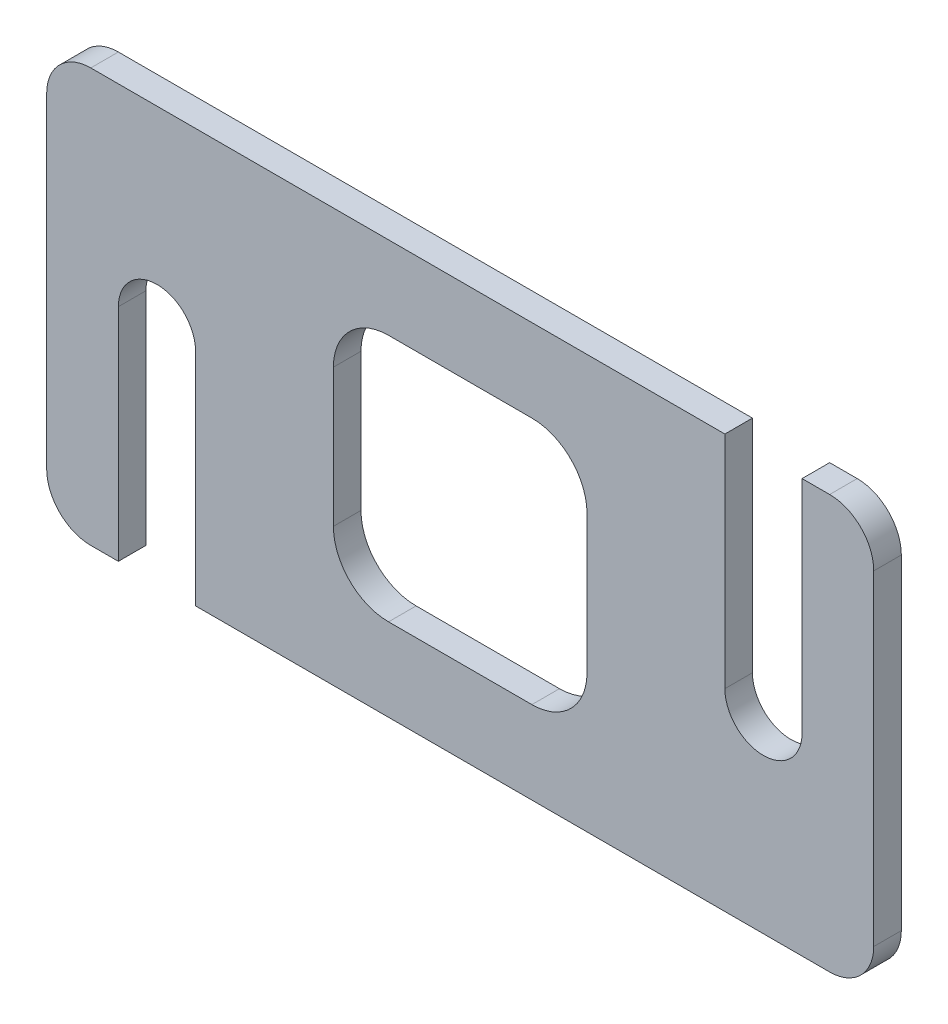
from build123d import *

# Parameters (mm, degrees)
SKETCH1_W           = 150
SKETCH1_H           = 75
BOSS_EXTRUDE1_DEPTH = 5
CUT_EXTRUDE1_DEPTH  = 85.001488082
CUT_EXTRUDE2_DEPTH  = 85.001488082
CUT_EXTRUDE3_DEPTH  = 85.001488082
FILLET1_R           = 8


with BuildPart() as part:
    # Sketch1 → Boss-Extrude1 (new body)
    with BuildSketch(Plane.XY):
        Rectangle(SKETCH1_W, SKETCH1_H)
    extrude(amount=BOSS_EXTRUDE1_DEPTH)

    # Sketch2 → Cut-Extrude1 (cut, through all)
    with BuildSketch(Plane.XY.offset(5)):
        with BuildLine():
            Line((-62, -37.5), (-48, -37.5))
            Line((-48, -37.5), (-48, 2.5))
            ThreePointArc((-48, 2.5), (-55, 9.5), (-62, 2.5))
            Line((-62, 2.5), (-62, -37.5))
        make_face()
    extrude(amount=-CUT_EXTRUDE1_DEPTH, mode=Mode.SUBTRACT)

    # Sketch3 → Cut-Extrude2 (cut, through all)
    with BuildSketch(Plane.XY.offset(5)):
        with BuildLine():
            Line((48, 37.5), (62, 37.5))
            Line((62, 37.5), (62, -2.5))
            ThreePointArc((62, -2.5), (55, -9.5), (48, -2.5))
            Line((48, -2.5), (48, 37.5))
        make_face()
    extrude(amount=-CUT_EXTRUDE2_DEPTH, mode=Mode.SUBTRACT)

    # Sketch4 → Cut-Extrude3 (cut, through all)
    with BuildSketch(Plane.XY.offset(5)):
        with BuildLine():
            Line((-13, 22.5), (13, 22.5))
            ThreePointArc((13, 22.5), (20.071067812, 19.571067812), (23, 12.5))
            Line((23, 12.5), (23, -12.5))
            ThreePointArc((23, -12.5), (20.071067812, -19.571067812), (13, -22.5))
            Line((13, -22.5), (-13, -22.5))
            ThreePointArc((-13, -22.5), (-20.071067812, -19.571067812), (-23, -12.5))
            Line((-23, -12.5), (-23, 12.5))
            ThreePointArc((-23, 12.5), (-20.071067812, 19.571067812), (-13, 22.5))
        make_face()
    extrude(amount=-CUT_EXTRUDE3_DEPTH, mode=Mode.SUBTRACT)

    # Fillet1
    fillet1_edges = [part.edges().sort_by_distance(p)[0] for p in [
        (75, -37.5, 2.5),
        (-75, -37.5, 2.5),
        (-75, 37.5, 2.5),
        (75, 37.5, 2.5),
    ]]
    fillet(fillet1_edges, radius=FILLET1_R)


solid = part.part
